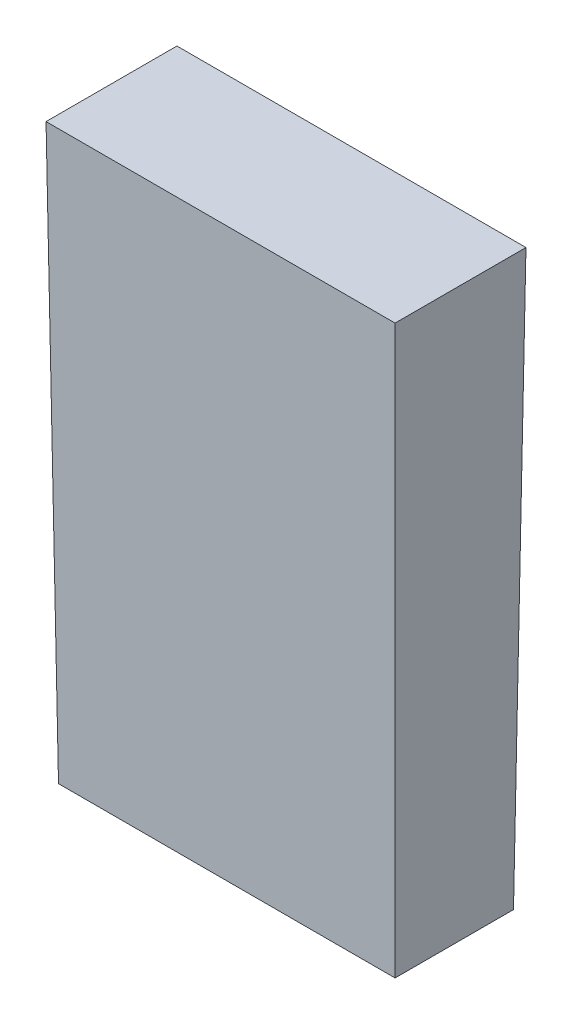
ISO-10303-21;
HEADER;
FILE_DESCRIPTION(('STEP AP214'),'2;1');
FILE_NAME('part.step','',(''),(''),'','','');
FILE_SCHEMA(('AUTOMOTIVE_DESIGN { 1 0 10303 214 1 1 1 1 }'));
ENDSEC;
DATA;
#1=APPLICATION_CONTEXT('core data for automotive mechanical design processes');
#2=APPLICATION_PROTOCOL_DEFINITION('international standard','automotive_design',2000,#1);
#3=PRODUCT_CONTEXT('',#1,'mechanical');
#4=PRODUCT('Part','Part','',(#3));
#5=PRODUCT_RELATED_PRODUCT_CATEGORY('part','',(#4));
#6=PRODUCT_DEFINITION_FORMATION('','',#4);
#7=PRODUCT_DEFINITION_CONTEXT('part definition',#1,'design');
#8=PRODUCT_DEFINITION('design','',#6,#7);
#9=PRODUCT_DEFINITION_SHAPE('','',#8);
#10=(LENGTH_UNIT() NAMED_UNIT(*) SI_UNIT(.MILLI.,.METRE.));
#11=(NAMED_UNIT(*) PLANE_ANGLE_UNIT() SI_UNIT($,.RADIAN.));
#12=(NAMED_UNIT(*) SI_UNIT($,.STERADIAN.) SOLID_ANGLE_UNIT());
#13=UNCERTAINTY_MEASURE_WITH_UNIT(LENGTH_MEASURE(1.E-05),#10,'distance_accuracy_value','');
#14=(GEOMETRIC_REPRESENTATION_CONTEXT(3) GLOBAL_UNCERTAINTY_ASSIGNED_CONTEXT((#13)) GLOBAL_UNIT_ASSIGNED_CONTEXT((#10,
#11,#12)) REPRESENTATION_CONTEXT('',''));
#15=CARTESIAN_POINT('',(0.,0.,0.));
#16=DIRECTION('',(0.,0.,1.));
#17=DIRECTION('',(1.,0.,0.));
#18=AXIS2_PLACEMENT_3D('',#15,#16,#17);
#19=CARTESIAN_POINT('',(0.,0.,16.66875));
#20=DIRECTION('',(0.999940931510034,0.0108689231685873,0.));
#21=DIRECTION('',(-0.0108689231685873,0.999940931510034,0.));
#22=AXIS2_PLACEMENT_3D('',#19,#20,#21);
#23=PLANE('',#22);
#24=DIRECTION('',(0.,0.,-1.));
#25=VECTOR('',#24,1.);
#26=CARTESIAN_POINT('',(-0.793749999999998,73.025,16.66875));
#27=LINE('',#26,#25);
#28=CARTESIAN_POINT('',(-0.793749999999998,73.025,16.66875));
#29=VERTEX_POINT('',#28);
#30=CARTESIAN_POINT('',(-0.793749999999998,73.025,0.));
#31=VERTEX_POINT('',#30);
#32=EDGE_CURVE('E95',#29,#31,#27,.T.);
#33=ORIENTED_EDGE('',*,*,#32,.T.);
#34=DIRECTION('',(0.0108682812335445,-0.999881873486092,0.0108682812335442));
#35=VECTOR('',#34,1.);
#36=CARTESIAN_POINT('',(0.00187514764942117,-0.172513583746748,0.795625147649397));
#37=LINE('',#36,#35);
#38=CARTESIAN_POINT('',(0.,0.,0.793749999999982));
#39=VERTEX_POINT('',#38);
#40=EDGE_CURVE('E78',#31,#39,#37,.T.);
#41=ORIENTED_EDGE('',*,*,#40,.T.);
#42=DIRECTION('',(0.,0.,-1.));
#43=VECTOR('',#42,1.);
#44=CARTESIAN_POINT('',(0.,0.,16.66875));
#45=LINE('',#44,#43);
#46=CARTESIAN_POINT('',(0.,0.,15.875));
#47=VERTEX_POINT('',#46);
#48=EDGE_CURVE('E11',#47,#39,#45,.T.);
#49=ORIENTED_EDGE('',*,*,#48,.F.);
#50=DIRECTION('',(-0.0108682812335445,0.999881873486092,0.0108682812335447));
#51=VECTOR('',#50,1.);
#52=CARTESIAN_POINT('',(-9.37573824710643E-05,0.00862567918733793,15.8750937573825));
#53=LINE('',#52,#51);
#54=EDGE_CURVE('E84',#47,#29,#53,.T.);
#55=ORIENTED_EDGE('',*,*,#54,.T.);
#56=EDGE_LOOP('',(#33,#41,#49,#55));
#57=FACE_BOUND('',#56,.T.);
#58=ADVANCED_FACE('F37',(#57),#23,.F.);
#59=CARTESIAN_POINT('',(0.,0.,16.66875));
#60=DIRECTION('',(0.,1.,0.));
#61=DIRECTION('',(0.,0.,1.));
#62=AXIS2_PLACEMENT_3D('',#59,#60,#61);
#63=PLANE('',#62);
#64=ORIENTED_EDGE('',*,*,#48,.T.);
#65=DIRECTION('',(1.,0.,0.));
#66=VECTOR('',#65,1.);
#67=CARTESIAN_POINT('',(-0.793749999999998,0.,0.793749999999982));
#68=LINE('',#67,#66);
#69=CARTESIAN_POINT('',(42.8625,0.,0.793749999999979));
#70=VERTEX_POINT('',#69);
#71=EDGE_CURVE('E92',#39,#70,#68,.T.);
#72=ORIENTED_EDGE('',*,*,#71,.T.);
#73=DIRECTION('',(0.,0.,-1.));
#74=VECTOR('',#73,1.);
#75=CARTESIAN_POINT('',(42.8625,0.,16.66875));
#76=LINE('',#75,#74);
#77=CARTESIAN_POINT('',(42.8625,0.,15.875));
#78=VERTEX_POINT('',#77);
#79=EDGE_CURVE('E45',#78,#70,#76,.T.);
#80=ORIENTED_EDGE('',*,*,#79,.F.);
#81=DIRECTION('',(1.,0.,0.));
#82=VECTOR('',#81,1.);
#83=CARTESIAN_POINT('',(-0.793749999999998,0.,15.875));
#84=LINE('',#83,#82);
#85=EDGE_CURVE('E104',#47,#78,#84,.T.);
#86=ORIENTED_EDGE('',*,*,#85,.F.);
#87=EDGE_LOOP('',(#64,#72,#80,#86));
#88=FACE_BOUND('',#87,.T.);
#89=ADVANCED_FACE('F107',(#88),#63,.F.);
#90=CARTESIAN_POINT('',(42.8625,0.,16.66875));
#91=DIRECTION('',(-0.999940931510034,0.0108689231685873,0.));
#92=DIRECTION('',(-0.0108689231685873,-0.999940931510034,0.));
#93=AXIS2_PLACEMENT_3D('',#90,#91,#92);
#94=PLANE('',#93);
#95=ORIENTED_EDGE('',*,*,#79,.T.);
#96=DIRECTION('',(0.0108682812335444,0.999881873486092,-0.0108682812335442));
#97=VECTOR('',#96,1.);
#98=CARTESIAN_POINT('',(42.8606248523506,-0.172513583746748,0.795625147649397));
#99=LINE('',#98,#97);
#100=CARTESIAN_POINT('',(43.65625,73.025,0.));
#101=VERTEX_POINT('',#100);
#102=EDGE_CURVE('E75',#70,#101,#99,.T.);
#103=ORIENTED_EDGE('',*,*,#102,.T.);
#104=DIRECTION('',(0.,0.,-1.));
#105=VECTOR('',#104,1.);
#106=CARTESIAN_POINT('',(43.65625,73.025,16.66875));
#107=LINE('',#106,#105);
#108=CARTESIAN_POINT('',(43.65625,73.025,16.66875));
#109=VERTEX_POINT('',#108);
#110=EDGE_CURVE('E89',#109,#101,#107,.T.);
#111=ORIENTED_EDGE('',*,*,#110,.F.);
#112=DIRECTION('',(-0.0108682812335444,-0.999881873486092,-0.0108682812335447));
#113=VECTOR('',#112,1.);
#114=CARTESIAN_POINT('',(42.8625937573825,0.00862567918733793,15.8750937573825));
#115=LINE('',#114,#113);
#116=EDGE_CURVE('E51',#109,#78,#115,.T.);
#117=ORIENTED_EDGE('',*,*,#116,.T.);
#118=EDGE_LOOP('',(#95,#103,#111,#117));
#119=FACE_BOUND('',#118,.T.);
#120=ADVANCED_FACE('F88',(#119),#94,.F.);
#121=CARTESIAN_POINT('',(-0.793749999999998,73.025,16.66875));
#122=DIRECTION('',(0.,-1.,0.));
#123=DIRECTION('',(0.,0.,-1.));
#124=AXIS2_PLACEMENT_3D('',#121,#122,#123);
#125=PLANE('',#124);
#126=DIRECTION('',(-1.,0.,0.));
#127=VECTOR('',#126,1.);
#128=CARTESIAN_POINT('',(-0.793749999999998,73.025,0.));
#129=LINE('',#128,#127);
#130=EDGE_CURVE('E72',#101,#31,#129,.T.);
#131=ORIENTED_EDGE('',*,*,#130,.T.);
#132=ORIENTED_EDGE('',*,*,#32,.F.);
#133=DIRECTION('',(-1.,0.,0.));
#134=VECTOR('',#133,1.);
#135=CARTESIAN_POINT('',(-0.793749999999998,73.025,16.66875));
#136=LINE('',#135,#134);
#137=EDGE_CURVE('E83',#109,#29,#136,.T.);
#138=ORIENTED_EDGE('',*,*,#137,.F.);
#139=ORIENTED_EDGE('',*,*,#110,.T.);
#140=EDGE_LOOP('',(#131,#132,#138,#139));
#141=FACE_BOUND('',#140,.T.);
#142=ADVANCED_FACE('F94',(#141),#125,.F.);
#143=CARTESIAN_POINT('',(-0.793749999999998,0.0086266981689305,0.793656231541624));
#144=DIRECTION('',(0.,0.0108689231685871,0.999940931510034));
#145=DIRECTION('',(0.,-0.999940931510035,0.0108689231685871));
#146=AXIS2_PLACEMENT_3D('',#143,#144,#145);
#147=PLANE('',#146);
#148=ORIENTED_EDGE('',*,*,#130,.F.);
#149=ORIENTED_EDGE('',*,*,#102,.F.);
#150=ORIENTED_EDGE('',*,*,#71,.F.);
#151=ORIENTED_EDGE('',*,*,#40,.F.);
#152=EDGE_LOOP('',(#148,#149,#150,#151));
#153=FACE_BOUND('',#152,.T.);
#154=ADVANCED_FACE('F74',(#153),#147,.F.);
#155=CARTESIAN_POINT('',(-0.793749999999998,-0.172533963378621,15.8731246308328));
#156=DIRECTION('',(0.,0.0108689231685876,-0.999940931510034));
#157=DIRECTION('',(0.,0.999940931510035,0.0108689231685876));
#158=AXIS2_PLACEMENT_3D('',#155,#156,#157);
#159=PLANE('',#158);
#160=ORIENTED_EDGE('',*,*,#85,.T.);
#161=ORIENTED_EDGE('',*,*,#116,.F.);
#162=ORIENTED_EDGE('',*,*,#137,.T.);
#163=ORIENTED_EDGE('',*,*,#54,.F.);
#164=EDGE_LOOP('',(#160,#161,#162,#163));
#165=FACE_BOUND('',#164,.T.);
#166=ADVANCED_FACE('F111',(#165),#159,.F.);
#167=CLOSED_SHELL('',(#58,#89,#120,#142,#154,#166));
#168=MANIFOLD_SOLID_BREP('B2',#167);
#169=ADVANCED_BREP_SHAPE_REPRESENTATION('',(#18,#168),#14);
#170=SHAPE_DEFINITION_REPRESENTATION(#9,#169);
ENDSEC;
END-ISO-10303-21;
